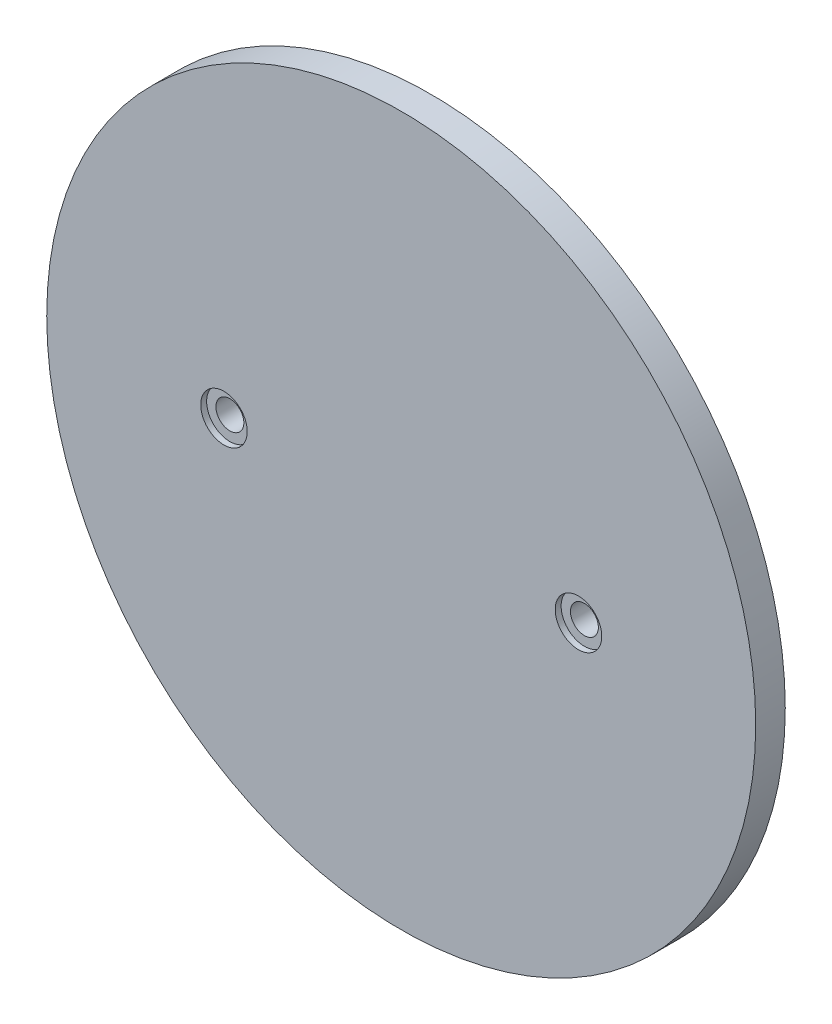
ISO-10303-21;
HEADER;
FILE_DESCRIPTION(('STEP AP214'),'2;1');
FILE_NAME('part.step','',(''),(''),'','','');
FILE_SCHEMA(('AUTOMOTIVE_DESIGN { 1 0 10303 214 1 1 1 1 }'));
ENDSEC;
DATA;
#1=APPLICATION_CONTEXT('core data for automotive mechanical design processes');
#2=APPLICATION_PROTOCOL_DEFINITION('international standard','automotive_design',2000,#1);
#3=PRODUCT_CONTEXT('',#1,'mechanical');
#4=PRODUCT('Part','Part','',(#3));
#5=PRODUCT_RELATED_PRODUCT_CATEGORY('part','',(#4));
#6=PRODUCT_DEFINITION_FORMATION('','',#4);
#7=PRODUCT_DEFINITION_CONTEXT('part definition',#1,'design');
#8=PRODUCT_DEFINITION('design','',#6,#7);
#9=PRODUCT_DEFINITION_SHAPE('','',#8);
#10=(LENGTH_UNIT() NAMED_UNIT(*) SI_UNIT(.MILLI.,.METRE.));
#11=(NAMED_UNIT(*) PLANE_ANGLE_UNIT() SI_UNIT($,.RADIAN.));
#12=(NAMED_UNIT(*) SI_UNIT($,.STERADIAN.) SOLID_ANGLE_UNIT());
#13=UNCERTAINTY_MEASURE_WITH_UNIT(LENGTH_MEASURE(1.E-05),#10,'distance_accuracy_value','');
#14=(GEOMETRIC_REPRESENTATION_CONTEXT(3) GLOBAL_UNCERTAINTY_ASSIGNED_CONTEXT((#13)) GLOBAL_UNIT_ASSIGNED_CONTEXT((#10,
#11,#12)) REPRESENTATION_CONTEXT('',''));
#15=CARTESIAN_POINT('',(0.,0.,0.));
#16=DIRECTION('',(0.,0.,1.));
#17=DIRECTION('',(1.,0.,0.));
#18=AXIS2_PLACEMENT_3D('',#15,#16,#17);
#19=CARTESIAN_POINT('',(-19.05,0.,3.175));
#20=DIRECTION('',(0.,0.,-1.));
#21=DIRECTION('',(-1.,0.,0.));
#22=AXIS2_PLACEMENT_3D('',#19,#20,#21);
#23=CYLINDRICAL_SURFACE('',#22,1.5);
#24=CARTESIAN_POINT('',(-19.05,0.,0.));
#25=DIRECTION('',(0.,0.,1.));
#26=DIRECTION('',(1.,0.,0.));
#27=AXIS2_PLACEMENT_3D('',#24,#25,#26);
#28=CIRCLE('',#27,1.5);
#29=CARTESIAN_POINT('',(-17.55,0.,0.));
#30=VERTEX_POINT('',#29);
#31=EDGE_CURVE('E57',#30,#30,#28,.T.);
#32=ORIENTED_EDGE('',*,*,#31,.F.);
#33=EDGE_LOOP('',(#32));
#34=FACE_BOUND('',#33,.T.);
#35=CARTESIAN_POINT('',(-19.05,0.,2.54));
#36=DIRECTION('',(0.,0.,1.));
#37=DIRECTION('',(1.,0.,0.));
#38=AXIS2_PLACEMENT_3D('',#35,#36,#37);
#39=CIRCLE('',#38,1.5);
#40=CARTESIAN_POINT('',(-17.55,0.,2.54));
#41=VERTEX_POINT('',#40);
#42=EDGE_CURVE('E46',#41,#41,#39,.T.);
#43=ORIENTED_EDGE('',*,*,#42,.T.);
#44=EDGE_LOOP('',(#43));
#45=FACE_BOUND('',#44,.T.);
#46=ADVANCED_FACE('F42',(#34,#45),#23,.F.);
#47=CARTESIAN_POINT('',(19.05,0.,3.175));
#48=DIRECTION('',(0.,0.,-1.));
#49=DIRECTION('',(-1.,0.,0.));
#50=AXIS2_PLACEMENT_3D('',#47,#48,#49);
#51=CYLINDRICAL_SURFACE('',#50,1.5);
#52=CARTESIAN_POINT('',(19.05,0.,0.));
#53=DIRECTION('',(0.,0.,1.));
#54=DIRECTION('',(-1.,0.,0.));
#55=AXIS2_PLACEMENT_3D('',#52,#53,#54);
#56=CIRCLE('',#55,1.5);
#57=CARTESIAN_POINT('',(17.55,0.,0.));
#58=VERTEX_POINT('',#57);
#59=EDGE_CURVE('E70',#58,#58,#56,.T.);
#60=ORIENTED_EDGE('',*,*,#59,.F.);
#61=EDGE_LOOP('',(#60));
#62=FACE_BOUND('',#61,.T.);
#63=CARTESIAN_POINT('',(19.05,0.,2.54));
#64=DIRECTION('',(0.,0.,1.));
#65=DIRECTION('',(1.,0.,0.));
#66=AXIS2_PLACEMENT_3D('',#63,#64,#65);
#67=CIRCLE('',#66,1.5);
#68=CARTESIAN_POINT('',(20.55,0.,2.54));
#69=VERTEX_POINT('',#68);
#70=EDGE_CURVE('E61',#69,#69,#67,.T.);
#71=ORIENTED_EDGE('',*,*,#70,.T.);
#72=EDGE_LOOP('',(#71));
#73=FACE_BOUND('',#72,.T.);
#74=ADVANCED_FACE('F99',(#62,#73),#51,.F.);
#75=CARTESIAN_POINT('',(0.,0.,3.175));
#76=DIRECTION('',(0.,0.,1.));
#77=DIRECTION('',(1.,0.,0.));
#78=AXIS2_PLACEMENT_3D('',#75,#76,#77);
#79=PLANE('',#78);
#80=CARTESIAN_POINT('',(-19.05,0.,3.175));
#81=DIRECTION('',(0.,0.,1.));
#82=DIRECTION('',(1.,0.,0.));
#83=AXIS2_PLACEMENT_3D('',#80,#81,#82);
#84=CIRCLE('',#83,2.5);
#85=CARTESIAN_POINT('',(-16.55,0.,3.175));
#86=VERTEX_POINT('',#85);
#87=EDGE_CURVE('E72',#86,#86,#84,.T.);
#88=ORIENTED_EDGE('',*,*,#87,.F.);
#89=EDGE_LOOP('',(#88));
#90=FACE_BOUND('',#89,.T.);
#91=CARTESIAN_POINT('',(19.05,0.,3.175));
#92=DIRECTION('',(0.,0.,1.));
#93=DIRECTION('',(1.,0.,0.));
#94=AXIS2_PLACEMENT_3D('',#91,#92,#93);
#95=CIRCLE('',#94,2.5);
#96=CARTESIAN_POINT('',(21.55,0.,3.175));
#97=VERTEX_POINT('',#96);
#98=EDGE_CURVE('E78',#97,#97,#95,.T.);
#99=ORIENTED_EDGE('',*,*,#98,.F.);
#100=EDGE_LOOP('',(#99));
#101=FACE_BOUND('',#100,.T.);
#102=CARTESIAN_POINT('',(0.,0.,3.175));
#103=DIRECTION('',(0.,0.,1.));
#104=DIRECTION('',(1.,0.,0.));
#105=AXIS2_PLACEMENT_3D('',#102,#103,#104);
#106=CIRCLE('',#105,38.1);
#107=CARTESIAN_POINT('',(38.1,0.,3.175));
#108=VERTEX_POINT('',#107);
#109=EDGE_CURVE('E10',#108,#108,#106,.T.);
#110=ORIENTED_EDGE('',*,*,#109,.T.);
#111=EDGE_LOOP('',(#110));
#112=FACE_BOUND('',#111,.T.);
#113=ADVANCED_FACE('F122',(#90,#101,#112),#79,.T.);
#114=CARTESIAN_POINT('',(0.,0.,0.));
#115=DIRECTION('',(0.,0.,1.));
#116=DIRECTION('',(1.,0.,0.));
#117=AXIS2_PLACEMENT_3D('',#114,#115,#116);
#118=PLANE('',#117);
#119=CARTESIAN_POINT('',(0.,0.,0.));
#120=DIRECTION('',(0.,0.,1.));
#121=DIRECTION('',(1.,0.,0.));
#122=AXIS2_PLACEMENT_3D('',#119,#120,#121);
#123=CIRCLE('',#122,38.1);
#124=CARTESIAN_POINT('',(38.1,0.,0.));
#125=VERTEX_POINT('',#124);
#126=EDGE_CURVE('E51',#125,#125,#123,.T.);
#127=ORIENTED_EDGE('',*,*,#126,.F.);
#128=EDGE_LOOP('',(#127));
#129=FACE_BOUND('',#128,.T.);
#130=ORIENTED_EDGE('',*,*,#31,.T.);
#131=EDGE_LOOP('',(#130));
#132=FACE_BOUND('',#131,.T.);
#133=ORIENTED_EDGE('',*,*,#59,.T.);
#134=EDGE_LOOP('',(#133));
#135=FACE_BOUND('',#134,.T.);
#136=ADVANCED_FACE('F95',(#129,#132,#135),#118,.F.);
#137=CARTESIAN_POINT('',(0.,0.,3.175));
#138=DIRECTION('',(0.,0.,-1.));
#139=DIRECTION('',(-1.,0.,0.));
#140=AXIS2_PLACEMENT_3D('',#137,#138,#139);
#141=CYLINDRICAL_SURFACE('',#140,38.1);
#142=ORIENTED_EDGE('',*,*,#109,.F.);
#143=EDGE_LOOP('',(#142));
#144=FACE_BOUND('',#143,.T.);
#145=ORIENTED_EDGE('',*,*,#126,.T.);
#146=EDGE_LOOP('',(#145));
#147=FACE_BOUND('',#146,.T.);
#148=ADVANCED_FACE('F44',(#144,#147),#141,.T.);
#149=CARTESIAN_POINT('',(19.05,0.,2.54));
#150=DIRECTION('',(0.,0.,1.));
#151=DIRECTION('',(1.,0.,0.));
#152=AXIS2_PLACEMENT_3D('',#149,#150,#151);
#153=CYLINDRICAL_SURFACE('',#152,2.5);
#154=CARTESIAN_POINT('',(19.05,0.,2.54));
#155=DIRECTION('',(0.,0.,1.));
#156=DIRECTION('',(1.,0.,0.));
#157=AXIS2_PLACEMENT_3D('',#154,#155,#156);
#158=CIRCLE('',#157,2.5);
#159=CARTESIAN_POINT('',(21.55,0.,2.54));
#160=VERTEX_POINT('',#159);
#161=EDGE_CURVE('E84',#160,#160,#158,.T.);
#162=ORIENTED_EDGE('',*,*,#161,.F.);
#163=EDGE_LOOP('',(#162));
#164=FACE_BOUND('',#163,.T.);
#165=ORIENTED_EDGE('',*,*,#98,.T.);
#166=EDGE_LOOP('',(#165));
#167=FACE_BOUND('',#166,.T.);
#168=ADVANCED_FACE('F114',(#164,#167),#153,.F.);
#169=CARTESIAN_POINT('',(19.05,0.,2.54));
#170=DIRECTION('',(0.,0.,1.));
#171=DIRECTION('',(1.,0.,0.));
#172=AXIS2_PLACEMENT_3D('',#169,#170,#171);
#173=PLANE('',#172);
#174=ORIENTED_EDGE('',*,*,#70,.F.);
#175=EDGE_LOOP('',(#174));
#176=FACE_BOUND('',#175,.T.);
#177=ORIENTED_EDGE('',*,*,#161,.T.);
#178=EDGE_LOOP('',(#177));
#179=FACE_BOUND('',#178,.T.);
#180=ADVANCED_FACE('F110',(#176,#179),#173,.T.);
#181=CARTESIAN_POINT('',(-19.05,0.,2.54));
#182=DIRECTION('',(0.,0.,1.));
#183=DIRECTION('',(1.,0.,0.));
#184=AXIS2_PLACEMENT_3D('',#181,#182,#183);
#185=CYLINDRICAL_SURFACE('',#184,2.5);
#186=CARTESIAN_POINT('',(-19.05,0.,2.54));
#187=DIRECTION('',(0.,0.,1.));
#188=DIRECTION('',(1.,0.,0.));
#189=AXIS2_PLACEMENT_3D('',#186,#187,#188);
#190=CIRCLE('',#189,2.5);
#191=CARTESIAN_POINT('',(-16.55,0.,2.54));
#192=VERTEX_POINT('',#191);
#193=EDGE_CURVE('E64',#192,#192,#190,.T.);
#194=ORIENTED_EDGE('',*,*,#193,.F.);
#195=EDGE_LOOP('',(#194));
#196=FACE_BOUND('',#195,.T.);
#197=ORIENTED_EDGE('',*,*,#87,.T.);
#198=EDGE_LOOP('',(#197));
#199=FACE_BOUND('',#198,.T.);
#200=ADVANCED_FACE('F105',(#196,#199),#185,.F.);
#201=CARTESIAN_POINT('',(-19.05,0.,2.54));
#202=DIRECTION('',(0.,0.,1.));
#203=DIRECTION('',(1.,0.,0.));
#204=AXIS2_PLACEMENT_3D('',#201,#202,#203);
#205=PLANE('',#204);
#206=ORIENTED_EDGE('',*,*,#42,.F.);
#207=EDGE_LOOP('',(#206));
#208=FACE_BOUND('',#207,.T.);
#209=ORIENTED_EDGE('',*,*,#193,.T.);
#210=EDGE_LOOP('',(#209));
#211=FACE_BOUND('',#210,.T.);
#212=ADVANCED_FACE('F103',(#208,#211),#205,.T.);
#213=CLOSED_SHELL('',(#46,#74,#113,#136,#148,#168,#180,#200,#212));
#214=MANIFOLD_SOLID_BREP('B2',#213);
#215=ADVANCED_BREP_SHAPE_REPRESENTATION('',(#18,#214),#14);
#216=SHAPE_DEFINITION_REPRESENTATION(#9,#215);
ENDSEC;
END-ISO-10303-21;
